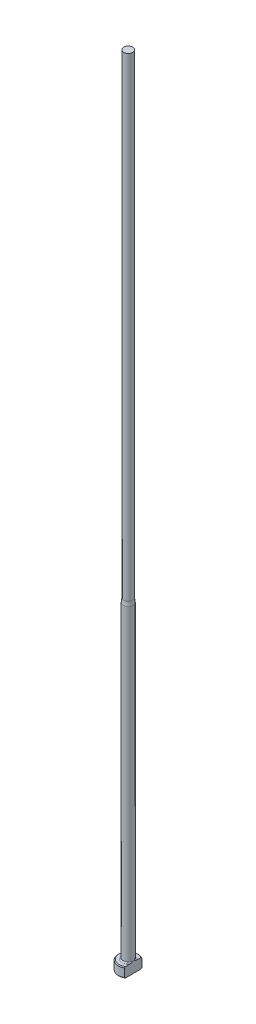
ISO-10303-21;
HEADER;
FILE_DESCRIPTION(('STEP AP214'),'2;1');
FILE_NAME('part.step','',(''),(''),'','','');
FILE_SCHEMA(('AUTOMOTIVE_DESIGN { 1 0 10303 214 1 1 1 1 }'));
ENDSEC;
DATA;
#1=APPLICATION_CONTEXT('core data for automotive mechanical design processes');
#2=APPLICATION_PROTOCOL_DEFINITION('international standard','automotive_design',2000,#1);
#3=PRODUCT_CONTEXT('',#1,'mechanical');
#4=PRODUCT('Part','Part','',(#3));
#5=PRODUCT_RELATED_PRODUCT_CATEGORY('part','',(#4));
#6=PRODUCT_DEFINITION_FORMATION('','',#4);
#7=PRODUCT_DEFINITION_CONTEXT('part definition',#1,'design');
#8=PRODUCT_DEFINITION('design','',#6,#7);
#9=PRODUCT_DEFINITION_SHAPE('','',#8);
#10=(LENGTH_UNIT() NAMED_UNIT(*) SI_UNIT(.MILLI.,.METRE.));
#11=(NAMED_UNIT(*) PLANE_ANGLE_UNIT() SI_UNIT($,.RADIAN.));
#12=(NAMED_UNIT(*) SI_UNIT($,.STERADIAN.) SOLID_ANGLE_UNIT());
#13=UNCERTAINTY_MEASURE_WITH_UNIT(LENGTH_MEASURE(1.E-05),#10,'distance_accuracy_value','');
#14=(GEOMETRIC_REPRESENTATION_CONTEXT(3) GLOBAL_UNCERTAINTY_ASSIGNED_CONTEXT((#13)) GLOBAL_UNIT_ASSIGNED_CONTEXT((#10,
#11,#12)) REPRESENTATION_CONTEXT('',''));
#15=CARTESIAN_POINT('',(0.,0.,0.));
#16=DIRECTION('',(0.,0.,1.));
#17=DIRECTION('',(1.,0.,0.));
#18=AXIS2_PLACEMENT_3D('',#15,#16,#17);
#19=CARTESIAN_POINT('',(-3.17499999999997,3.175,0.));
#20=DIRECTION('',(0.,1.,0.));
#21=DIRECTION('',(0.,0.,1.));
#22=AXIS2_PLACEMENT_3D('',#19,#20,#21);
#23=PLANE('',#22);
#24=CARTESIAN_POINT('',(0.,3.175,0.));
#25=DIRECTION('',(0.,1.,0.));
#26=DIRECTION('',(0.,0.,1.));
#27=AXIS2_PLACEMENT_3D('',#24,#25,#26);
#28=CIRCLE('',#27,2.92099999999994);
#29=CARTESIAN_POINT('',(1.58749999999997,3.175,-2.45195529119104));
#30=VERTEX_POINT('',#29);
#31=CARTESIAN_POINT('',(1.58749999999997,3.175,2.45195529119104));
#32=VERTEX_POINT('',#31);
#33=EDGE_CURVE('E105',#30,#32,#28,.T.);
#34=ORIENTED_EDGE('',*,*,#33,.T.);
#35=DIRECTION('',(0.,0.,1.));
#36=VECTOR('',#35,1.);
#37=CARTESIAN_POINT('',(1.58749999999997,3.17499999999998,2.74963065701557));
#38=LINE('',#37,#36);
#39=CARTESIAN_POINT('',(1.58749999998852,3.175,1.16397422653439));
#40=VERTEX_POINT('',#39);
#41=EDGE_CURVE('E126',#40,#32,#38,.T.);
#42=ORIENTED_EDGE('',*,*,#41,.F.);
#43=CARTESIAN_POINT('',(0.,3.175,0.));
#44=DIRECTION('',(0.,1.,0.));
#45=DIRECTION('',(0.,0.,1.));
#46=AXIS2_PLACEMENT_3D('',#43,#44,#45);
#47=CIRCLE('',#46,1.96849999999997);
#48=CARTESIAN_POINT('',(1.58749999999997,3.175,-1.16397422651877));
#49=VERTEX_POINT('',#48);
#50=EDGE_CURVE('E11',#40,#49,#47,.F.);
#51=ORIENTED_EDGE('',*,*,#50,.T.);
#52=EDGE_CURVE('E52',#30,#49,#38,.T.);
#53=ORIENTED_EDGE('',*,*,#52,.F.);
#54=EDGE_LOOP('',(#34,#42,#51,#53));
#55=FACE_BOUND('',#54,.T.);
#56=ADVANCED_FACE('F32',(#55),#23,.T.);
#57=CARTESIAN_POINT('',(0.,259.958771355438,0.));
#58=DIRECTION('',(0.,1.,0.));
#59=DIRECTION('',(0.,0.,1.));
#60=AXIS2_PLACEMENT_3D('',#57,#58,#59);
#61=CYLINDRICAL_SURFACE('',#60,3.17499999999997);
#62=CARTESIAN_POINT('',(0.,2.92100000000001,0.));
#63=DIRECTION('',(0.,1.,0.));
#64=DIRECTION('',(0.,0.,1.));
#65=AXIS2_PLACEMENT_3D('',#62,#63,#64);
#66=CIRCLE('',#65,3.17499999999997);
#67=CARTESIAN_POINT('',(1.58749999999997,2.92100000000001,2.74963065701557));
#68=VERTEX_POINT('',#67);
#69=CARTESIAN_POINT('',(1.58749999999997,2.92100000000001,-2.74963065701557));
#70=VERTEX_POINT('',#69);
#71=EDGE_CURVE('E98',#68,#70,#66,.F.);
#72=ORIENTED_EDGE('',*,*,#71,.T.);
#73=DIRECTION('',(0.,-1.,0.));
#74=VECTOR('',#73,1.);
#75=CARTESIAN_POINT('',(1.58749999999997,254.001,-2.74963065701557));
#76=LINE('',#75,#74);
#77=CARTESIAN_POINT('',(1.58749999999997,0.253999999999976,-2.74963065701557));
#78=VERTEX_POINT('',#77);
#79=EDGE_CURVE('E141',#70,#78,#76,.T.);
#80=ORIENTED_EDGE('',*,*,#79,.T.);
#81=CARTESIAN_POINT('',(0.,0.253999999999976,0.));
#82=DIRECTION('',(0.,-1.,0.));
#83=DIRECTION('',(0.,0.,-1.));
#84=AXIS2_PLACEMENT_3D('',#81,#82,#83);
#85=CIRCLE('',#84,3.17499999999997);
#86=CARTESIAN_POINT('',(1.58749999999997,0.253999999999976,2.74963065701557));
#87=VERTEX_POINT('',#86);
#88=EDGE_CURVE('E95',#78,#87,#85,.F.);
#89=ORIENTED_EDGE('',*,*,#88,.T.);
#90=DIRECTION('',(0.,-1.,0.));
#91=VECTOR('',#90,1.);
#92=CARTESIAN_POINT('',(1.58749999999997,254.001,2.74963065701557));
#93=LINE('',#92,#91);
#94=EDGE_CURVE('E88',#68,#87,#93,.T.);
#95=ORIENTED_EDGE('',*,*,#94,.F.);
#96=EDGE_LOOP('',(#72,#80,#89,#95));
#97=FACE_BOUND('',#96,.T.);
#98=ADVANCED_FACE('F191',(#97),#61,.T.);
#99=CARTESIAN_POINT('',(0.,0.,0.));
#100=DIRECTION('',(0.,-1.,0.));
#101=DIRECTION('',(0.,0.,-1.));
#102=AXIS2_PLACEMENT_3D('',#99,#100,#101);
#103=PLANE('',#102);
#104=CARTESIAN_POINT('',(0.,0.,0.));
#105=DIRECTION('',(0.,-1.,0.));
#106=DIRECTION('',(0.,0.,-1.));
#107=AXIS2_PLACEMENT_3D('',#104,#105,#106);
#108=CIRCLE('',#107,2.92100000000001);
#109=CARTESIAN_POINT('',(1.58749999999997,0.,2.45195529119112));
#110=VERTEX_POINT('',#109);
#111=CARTESIAN_POINT('',(1.58749999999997,0.,-2.45195529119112));
#112=VERTEX_POINT('',#111);
#113=EDGE_CURVE('E93',#110,#112,#108,.T.);
#114=ORIENTED_EDGE('',*,*,#113,.T.);
#115=DIRECTION('',(0.,0.,1.));
#116=VECTOR('',#115,1.);
#117=CARTESIAN_POINT('',(1.58749999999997,0.,2.74963065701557));
#118=LINE('',#117,#116);
#119=EDGE_CURVE('E78',#112,#110,#118,.T.);
#120=ORIENTED_EDGE('',*,*,#119,.T.);
#121=EDGE_LOOP('',(#114,#120));
#122=FACE_BOUND('',#121,.T.);
#123=ADVANCED_FACE('F97',(#122),#103,.T.);
#124=CARTESIAN_POINT('',(0.,3.17499999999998,0.));
#125=DIRECTION('',(0.,-1.,0.));
#126=DIRECTION('',(0.,0.,-1.));
#127=AXIS2_PLACEMENT_3D('',#124,#125,#126);
#128=CONICAL_SURFACE('',#127,2.92099999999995,0.785398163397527);
#129=ORIENTED_EDGE('',*,*,#71,.F.);
#130=CARTESIAN_POINT('',(1.58749999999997,-0.16162066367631,-6.0529050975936));
#131=CARTESIAN_POINT('',(1.58749999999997,-0.0288893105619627,-5.91567682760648));
#132=CARTESIAN_POINT('',(1.58749999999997,0.103699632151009,-5.7783103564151));
#133=CARTESIAN_POINT('',(1.58749999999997,0.368508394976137,-5.50321874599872));
#134=CARTESIAN_POINT('',(1.58749999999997,0.500728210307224,-5.36549360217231));
#135=CARTESIAN_POINT('',(1.58749999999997,0.764778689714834,-5.08953516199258));
#136=CARTESIAN_POINT('',(1.58749999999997,0.896609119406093,-4.9513016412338));
#137=CARTESIAN_POINT('',(1.58749999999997,1.15968706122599,-4.67428233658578));
#138=CARTESIAN_POINT('',(1.58749999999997,1.29093457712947,-4.53549655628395));
#139=CARTESIAN_POINT('',(1.58749999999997,1.55007705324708,-4.25997724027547));
#140=CARTESIAN_POINT('',(1.58749999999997,1.67798684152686,-4.12325766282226));
#141=CARTESIAN_POINT('',(1.58749999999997,1.9328486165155,-3.84892898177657));
#142=CARTESIAN_POINT('',(1.58749999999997,2.05980060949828,-3.71131988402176));
#143=CARTESIAN_POINT('',(1.58749999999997,2.31237508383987,-3.43493978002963));
#144=CARTESIAN_POINT('',(1.58749999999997,2.43799784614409,-3.29616903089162));
#145=CARTESIAN_POINT('',(1.58749999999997,2.68741369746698,-3.01699558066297));
#146=CARTESIAN_POINT('',(1.58749999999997,2.81120686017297,-2.8765929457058));
#147=CARTESIAN_POINT('',(1.58749999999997,3.00875865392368,-2.64816703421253));
#148=CARTESIAN_POINT('',(1.58749999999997,3.08336151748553,-2.56087478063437));
#149=CARTESIAN_POINT('',(1.58749999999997,3.2312387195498,-2.38515423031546));
#150=CARTESIAN_POINT('',(1.58749999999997,3.30451292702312,-2.29672582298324));
#151=CARTESIAN_POINT('',(1.58749999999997,3.45004422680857,-2.1174740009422));
#152=CARTESIAN_POINT('',(1.58749999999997,3.5222823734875,-2.02663514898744));
#153=CARTESIAN_POINT('',(1.58749999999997,3.66423097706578,-1.8430252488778));
#154=CARTESIAN_POINT('',(1.58749999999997,3.73394203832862,-1.75025467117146));
#155=CARTESIAN_POINT('',(1.58749999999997,3.87080633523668,-1.5606747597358));
#156=CARTESIAN_POINT('',(1.58749999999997,3.93790459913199,-1.46382547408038));
#157=CARTESIAN_POINT('',(1.58749999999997,4.06669147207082,-1.26632594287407));
#158=CARTESIAN_POINT('',(1.58749999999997,4.1283726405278,-1.16567073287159));
#159=CARTESIAN_POINT('',(1.58749999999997,4.21402252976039,-1.01165766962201));
#160=CARTESIAN_POINT('',(1.58749999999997,4.24127929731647,-0.960142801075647));
#161=CARTESIAN_POINT('',(1.58749999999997,4.2930979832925,-0.855780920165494));
#162=CARTESIAN_POINT('',(1.58749999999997,4.31765941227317,-0.802933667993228));
#163=CARTESIAN_POINT('',(1.58749999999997,4.38614656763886,-0.642461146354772));
#164=CARTESIAN_POINT('',(1.58749999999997,4.42510149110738,-0.532518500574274));
#165=CARTESIAN_POINT('',(1.58749999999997,4.46726244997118,-0.367680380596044));
#166=CARTESIAN_POINT('',(1.58749999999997,4.47844427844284,-0.314802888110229));
#167=CARTESIAN_POINT('',(1.58749999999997,4.49576654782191,-0.208209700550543));
#168=CARTESIAN_POINT('',(1.58749999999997,4.50190743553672,-0.154494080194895));
#169=CARTESIAN_POINT('',(1.58749999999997,4.50871296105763,-0.0468792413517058));
#170=CARTESIAN_POINT('',(1.58749999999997,4.5093945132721,0.00701889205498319));
#171=CARTESIAN_POINT('',(1.58749999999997,4.50527679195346,0.114606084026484));
#172=CARTESIAN_POINT('',(1.58749999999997,4.50047706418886,0.168295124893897));
#173=CARTESIAN_POINT('',(1.58749999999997,4.48579689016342,0.27448544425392));
#174=CARTESIAN_POINT('',(1.58749999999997,4.47596081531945,0.32699298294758));
#175=CARTESIAN_POINT('',(1.58749999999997,4.45181809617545,0.430974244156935));
#176=CARTESIAN_POINT('',(1.58749999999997,4.4375096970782,0.482447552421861));
#177=CARTESIAN_POINT('',(1.58749999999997,4.40502489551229,0.584460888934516));
#178=CARTESIAN_POINT('',(1.58749999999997,4.386827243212,0.634994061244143));
#179=CARTESIAN_POINT('',(1.58749999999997,4.34729308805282,0.734789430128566));
#180=CARTESIAN_POINT('',(1.58749999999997,4.3259572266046,0.784051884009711));
#181=CARTESIAN_POINT('',(1.58749999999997,4.25791922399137,0.930549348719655));
#182=CARTESIAN_POINT('',(1.58749999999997,4.20736047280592,1.0259880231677));
#183=CARTESIAN_POINT('',(1.58749999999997,4.0995545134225,1.21304313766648));
#184=CARTESIAN_POINT('',(1.58749999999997,4.04229912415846,1.30465471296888));
#185=CARTESIAN_POINT('',(1.58749999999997,3.92308746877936,1.48526211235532));
#186=CARTESIAN_POINT('',(1.58749999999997,3.86111349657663,1.57424615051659));
#187=CARTESIAN_POINT('',(1.58749999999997,3.73408621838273,1.74990003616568));
#188=CARTESIAN_POINT('',(1.58749999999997,3.66903444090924,1.83657099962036));
#189=CARTESIAN_POINT('',(1.58749999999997,3.53583371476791,2.00931764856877));
#190=CARTESIAN_POINT('',(1.58749999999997,3.46765527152,2.09537048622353));
#191=CARTESIAN_POINT('',(1.58749999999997,3.32960643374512,2.26611736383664));
#192=CARTESIAN_POINT('',(1.58749999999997,3.25973586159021,2.35081125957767));
#193=CARTESIAN_POINT('',(1.58749999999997,3.04858139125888,2.60290121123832));
#194=CARTESIAN_POINT('',(1.58749999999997,2.90542388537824,2.76872537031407));
#195=CARTESIAN_POINT('',(1.58749999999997,2.64069522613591,3.06970913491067));
#196=CARTESIAN_POINT('',(1.58749999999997,2.51959458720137,3.20528660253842));
#197=CARTESIAN_POINT('',(1.58749999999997,2.27590400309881,3.47510321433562));
#198=CARTESIAN_POINT('',(1.58749999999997,2.15331401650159,3.60934232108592));
#199=CARTESIAN_POINT('',(1.58749999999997,1.90694239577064,3.87695374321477));
#200=CARTESIAN_POINT('',(1.58749999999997,1.78315974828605,4.0103251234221));
#201=CARTESIAN_POINT('',(1.58749999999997,1.53478104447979,4.27630880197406));
#202=CARTESIAN_POINT('',(1.58749999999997,1.41018498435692,4.40892109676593));
#203=CARTESIAN_POINT('',(1.58749999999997,1.0457468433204,4.79499418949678));
#204=CARTESIAN_POINT('',(1.58749999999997,0.80507680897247,5.04767313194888));
#205=CARTESIAN_POINT('',(1.58749999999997,0.443121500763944,5.42550911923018));
#206=CARTESIAN_POINT('',(1.58749999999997,0.322378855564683,5.55118772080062));
#207=CARTESIAN_POINT('',(1.58749999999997,0.0805914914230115,5.80225207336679));
#208=CARTESIAN_POINT('',(1.58749999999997,-0.040453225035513,5.92763782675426));
#209=CARTESIAN_POINT('',(1.58749999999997,-0.161620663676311,6.0529050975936));
#210=B_SPLINE_CURVE_WITH_KNOTS('',3,(#130,#131,#132,#133,#134,#135,#136,#137,#138,#139,#140,
#141,#142,#143,#144,#145,#146,#147,#148,#149,#150,#151,#152,#153,#154,#155,#156,#157,#158,#159,
#160,#161,#162,#163,#164,#165,#166,#167,#168,#169,#170,#171,#172,#173,#174,#175,#176,#177,#178,
#179,#180,#181,#182,#183,#184,#185,#186,#187,#188,#189,#190,#191,#192,#193,#194,#195,#196,#197,
#198,#199,#200,#201,#202,#203,#204,#205,#206,#207,#208,#209),.UNSPECIFIED.,.F.,.F.,(4,2,2,2,2,2,
2,2,2,2,2,2,2,2,2,2,2,2,2,2,2,2,2,2,2,2,2,2,2,2,2,2,2,2,2,2,2,2,2,4),(0.,0.572750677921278,
1.14550874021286,1.71856057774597,2.29160869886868,2.85328006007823,3.4149477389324,
3.97649423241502,4.53801804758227,4.88249307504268,5.22700189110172,5.5751532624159,
5.92322081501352,6.27657800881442,6.63041319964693,6.80518126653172,6.9799810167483,
7.3282426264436,7.49018491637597,7.65211285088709,7.81353889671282,7.97497832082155,
8.13501929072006,8.29512313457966,8.45612518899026,8.61709438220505,8.94062993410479,
9.2645649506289,9.58978187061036,9.91483894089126,10.2441741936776,10.5735441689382,
11.2306812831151,11.7760337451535,12.3214014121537,12.8672825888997,13.4131663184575,
14.4600164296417,14.9828595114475,15.5056983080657),.UNSPECIFIED.);
#211=EDGE_CURVE('E118',#32,#68,#210,.T.);
#212=ORIENTED_EDGE('',*,*,#211,.F.);
#213=ORIENTED_EDGE('',*,*,#33,.F.);
#214=EDGE_CURVE('E117',#70,#30,#210,.T.);
#215=ORIENTED_EDGE('',*,*,#214,.F.);
#216=EDGE_LOOP('',(#129,#212,#213,#215));
#217=FACE_BOUND('',#216,.T.);
#218=ADVANCED_FACE('F162',(#217),#128,.T.);
#219=CARTESIAN_POINT('',(0.,0.253999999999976,0.));
#220=DIRECTION('',(0.,1.,0.));
#221=DIRECTION('',(0.,0.,1.));
#222=AXIS2_PLACEMENT_3D('',#219,#220,#221);
#223=CONICAL_SURFACE('',#222,3.17499999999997,0.785398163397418);
#224=ORIENTED_EDGE('',*,*,#88,.F.);
#225=CARTESIAN_POINT('',(1.58749999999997,3.33662066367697,6.0529050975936));
#226=CARTESIAN_POINT('',(1.58749999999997,3.20388931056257,5.91567682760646));
#227=CARTESIAN_POINT('',(1.58749999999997,3.07130036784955,5.77831035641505));
#228=CARTESIAN_POINT('',(1.58749999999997,2.80649160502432,5.50321874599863));
#229=CARTESIAN_POINT('',(1.58749999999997,2.67427178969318,5.3654936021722));
#230=CARTESIAN_POINT('',(1.58749999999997,2.41022131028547,5.08953516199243));
#231=CARTESIAN_POINT('',(1.58749999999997,2.27839088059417,4.95130164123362));
#232=CARTESIAN_POINT('',(1.58749999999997,2.01531293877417,4.67428233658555));
#233=CARTESIAN_POINT('',(1.58749999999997,1.88406542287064,4.5354965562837));
#234=CARTESIAN_POINT('',(1.58749999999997,1.62492294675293,4.25997724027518));
#235=CARTESIAN_POINT('',(1.58749999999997,1.49701315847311,4.12325766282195));
#236=CARTESIAN_POINT('',(1.58749999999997,1.24215138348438,3.84892898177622));
#237=CARTESIAN_POINT('',(1.58749999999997,1.11519939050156,3.71131988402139));
#238=CARTESIAN_POINT('',(1.58749999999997,0.862624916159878,3.43493978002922));
#239=CARTESIAN_POINT('',(1.58749999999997,0.737002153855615,3.29616903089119));
#240=CARTESIAN_POINT('',(1.58749999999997,0.487586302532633,3.01699558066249));
#241=CARTESIAN_POINT('',(1.58749999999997,0.363793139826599,2.8765929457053));
#242=CARTESIAN_POINT('',(1.58749999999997,0.166241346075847,2.64816703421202));
#243=CARTESIAN_POINT('',(1.58749999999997,0.0916384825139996,2.56087478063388));
#244=CARTESIAN_POINT('',(1.58749999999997,-0.0562387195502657,2.385154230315));
#245=CARTESIAN_POINT('',(1.58749999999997,-0.129512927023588,2.29672582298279));
#246=CARTESIAN_POINT('',(1.58749999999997,-0.27504422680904,2.11747400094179));
#247=CARTESIAN_POINT('',(1.58749999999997,-0.347282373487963,2.02663514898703));
#248=CARTESIAN_POINT('',(1.58749999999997,-0.489230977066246,1.84302524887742));
#249=CARTESIAN_POINT('',(1.58749999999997,-0.558942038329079,1.7502546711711));
#250=CARTESIAN_POINT('',(1.58749999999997,-0.695806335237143,1.56067475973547));
#251=CARTESIAN_POINT('',(1.58749999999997,-0.762904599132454,1.46382547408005));
#252=CARTESIAN_POINT('',(1.58749999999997,-0.891691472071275,1.26632594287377));
#253=CARTESIAN_POINT('',(1.58749999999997,-0.953372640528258,1.16567073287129));
#254=CARTESIAN_POINT('',(1.58749999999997,-1.03902252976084,1.01165766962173));
#255=CARTESIAN_POINT('',(1.58749999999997,-1.06627929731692,0.960142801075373));
#256=CARTESIAN_POINT('',(1.58749999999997,-1.11809798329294,0.85578092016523));
#257=CARTESIAN_POINT('',(1.58749999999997,-1.14265941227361,0.802933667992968));
#258=CARTESIAN_POINT('',(1.58749999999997,-1.21114656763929,0.642461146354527));
#259=CARTESIAN_POINT('',(1.58749999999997,-1.2501014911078,0.532518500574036));
#260=CARTESIAN_POINT('',(1.58749999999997,-1.29226244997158,0.367680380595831));
#261=CARTESIAN_POINT('',(1.58749999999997,-1.30344427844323,0.314802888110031));
#262=CARTESIAN_POINT('',(1.58749999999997,-1.32076654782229,0.208209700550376));
#263=CARTESIAN_POINT('',(1.58749999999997,-1.3269074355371,0.154494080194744));
#264=CARTESIAN_POINT('',(1.58749999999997,-1.333712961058,0.0468792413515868));
#265=CARTESIAN_POINT('',(1.58749999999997,-1.33439451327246,-0.00701889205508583));
#266=CARTESIAN_POINT('',(1.58749999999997,-1.33027679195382,-0.114606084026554));
#267=CARTESIAN_POINT('',(1.58749999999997,-1.32547706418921,-0.168295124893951));
#268=CARTESIAN_POINT('',(1.58749999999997,-1.31079689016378,-0.274485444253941));
#269=CARTESIAN_POINT('',(1.58749999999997,-1.3009608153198,-0.326992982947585));
#270=CARTESIAN_POINT('',(1.58749999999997,-1.27681809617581,-0.430974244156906));
#271=CARTESIAN_POINT('',(1.58749999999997,-1.26250969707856,-0.482447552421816));
#272=CARTESIAN_POINT('',(1.58749999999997,-1.23002489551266,-0.584460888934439));
#273=CARTESIAN_POINT('',(1.58749999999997,-1.21182724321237,-0.634994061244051));
#274=CARTESIAN_POINT('',(1.58749999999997,-1.1722930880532,-0.734789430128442));
#275=CARTESIAN_POINT('',(1.58749999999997,-1.15095722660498,-0.784051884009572));
#276=CARTESIAN_POINT('',(1.58749999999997,-1.08291922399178,-0.93054934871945));
#277=CARTESIAN_POINT('',(1.58749999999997,-1.03236047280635,-1.02598802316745));
#278=CARTESIAN_POINT('',(1.58749999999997,-0.924554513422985,-1.21304313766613));
#279=CARTESIAN_POINT('',(1.58749999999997,-0.86729912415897,-1.30465471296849));
#280=CARTESIAN_POINT('',(1.58749999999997,-0.748087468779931,-1.48526211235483));
#281=CARTESIAN_POINT('',(1.58749999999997,-0.686113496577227,-1.57424615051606));
#282=CARTESIAN_POINT('',(1.58749999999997,-0.55908621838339,-1.74990003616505));
#283=CARTESIAN_POINT('',(1.58749999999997,-0.494034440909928,-1.83657099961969));
#284=CARTESIAN_POINT('',(1.58749999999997,-0.360833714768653,-2.00931764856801));
#285=CARTESIAN_POINT('',(1.58749999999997,-0.292655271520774,-2.09537048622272));
#286=CARTESIAN_POINT('',(1.58749999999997,-0.154606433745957,-2.26611736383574));
#287=CARTESIAN_POINT('',(1.58749999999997,-0.0847358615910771,-2.35081125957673));
#288=CARTESIAN_POINT('',(1.58749999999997,0.126418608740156,-2.60290121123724));
#289=CARTESIAN_POINT('',(1.58749999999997,0.269576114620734,-2.76872537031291));
#290=CARTESIAN_POINT('',(1.58749999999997,0.534304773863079,-3.06970913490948));
#291=CARTESIAN_POINT('',(1.58749999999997,0.655405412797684,-3.20528660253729));
#292=CARTESIAN_POINT('',(1.58749999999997,0.899095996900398,-3.47510321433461));
#293=CARTESIAN_POINT('',(1.58749999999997,1.02168598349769,-3.60934232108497));
#294=CARTESIAN_POINT('',(1.58749999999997,1.26805760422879,-3.87695374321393));
#295=CARTESIAN_POINT('',(1.58749999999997,1.39184025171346,-4.01032512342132));
#296=CARTESIAN_POINT('',(1.58749999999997,1.64021895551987,-4.2763088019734));
#297=CARTESIAN_POINT('',(1.58749999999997,1.76481501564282,-4.40892109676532));
#298=CARTESIAN_POINT('',(1.58749999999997,2.12925315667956,-4.79499418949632));
#299=CARTESIAN_POINT('',(1.58749999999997,2.36992319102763,-5.04767313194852));
#300=CARTESIAN_POINT('',(1.58749999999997,2.73187849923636,-5.42550911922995));
#301=CARTESIAN_POINT('',(1.58749999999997,2.85262114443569,-5.55118772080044));
#302=CARTESIAN_POINT('',(1.58749999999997,3.09440850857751,-5.8022520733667));
#303=CARTESIAN_POINT('',(1.58749999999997,3.2154532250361,-5.92763782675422));
#304=CARTESIAN_POINT('',(1.58749999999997,3.33662066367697,-6.0529050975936));
#305=B_SPLINE_CURVE_WITH_KNOTS('',3,(#225,#226,#227,#228,#229,#230,#231,#232,#233,#234,#235,
#236,#237,#238,#239,#240,#241,#242,#243,#244,#245,#246,#247,#248,#249,#250,#251,#252,#253,#254,
#255,#256,#257,#258,#259,#260,#261,#262,#263,#264,#265,#266,#267,#268,#269,#270,#271,#272,#273,
#274,#275,#276,#277,#278,#279,#280,#281,#282,#283,#284,#285,#286,#287,#288,#289,#290,#291,#292,
#293,#294,#295,#296,#297,#298,#299,#300,#301,#302,#303,#304),.UNSPECIFIED.,.F.,.F.,(4,2,2,2,2,2,
2,2,2,2,2,2,2,2,2,2,2,2,2,2,2,2,2,2,2,2,2,2,2,2,2,2,2,2,2,2,2,2,2,4),(0.,0.57275067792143,
1.14550874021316,1.71856057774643,2.29160869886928,2.85328006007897,3.41494773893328,
3.97649423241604,4.53801804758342,4.88249307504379,5.2270018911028,5.57515326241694,
5.92322081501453,6.27657800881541,6.63041319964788,6.80518126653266,6.97998101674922,
7.32824262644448,7.49018491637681,7.65211285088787,7.81353889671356,7.97497832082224,
8.1350192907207,8.29512313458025,8.45612518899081,8.61709438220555,8.94062993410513,
9.26456495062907,9.58978187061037,9.91483894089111,10.2441741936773,10.5735441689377,
11.2306812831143,11.776033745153,12.3214014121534,12.8672825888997,13.4131663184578,
14.4600164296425,14.9828595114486,15.505698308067),.UNSPECIFIED.);
#306=EDGE_CURVE('E81',#112,#78,#305,.T.);
#307=ORIENTED_EDGE('',*,*,#306,.F.);
#308=ORIENTED_EDGE('',*,*,#113,.F.);
#309=EDGE_CURVE('E84',#87,#110,#305,.T.);
#310=ORIENTED_EDGE('',*,*,#309,.F.);
#311=EDGE_LOOP('',(#224,#307,#308,#310));
#312=FACE_BOUND('',#311,.T.);
#313=ADVANCED_FACE('F92',(#312),#223,.T.);
#314=CARTESIAN_POINT('',(0.,3.556,0.));
#315=DIRECTION('',(0.,1.,0.));
#316=DIRECTION('',(0.,0.,1.));
#317=AXIS2_PLACEMENT_3D('',#314,#315,#316);
#318=TOROIDAL_SURFACE('',#317,1.96849999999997,0.381);
#319=CARTESIAN_POINT('',(1.58749999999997,3.556,0.));
#320=CARTESIAN_POINT('',(1.58749999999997,3.55599928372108,-9.72839998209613E-12));
#321=CARTESIAN_POINT('',(1.58749999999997,3.55599856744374,-1.16390048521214E-07));
#322=CARTESIAN_POINT('',(1.58749999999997,3.55599717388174,-5.02802253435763E-07));
#323=CARTESIAN_POINT('',(1.58749999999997,3.55599649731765,-7.75049116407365E-07));
#324=CARTESIAN_POINT('',(1.58749999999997,3.55599515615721,-1.43578185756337E-06));
#325=CARTESIAN_POINT('',(1.58749999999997,3.55599449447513,-1.83004116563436E-06));
#326=CARTESIAN_POINT('',(1.58749999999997,3.55599322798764,-2.69326525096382E-06));
#327=CARTESIAN_POINT('',(1.58749999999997,3.55599262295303,-3.16190628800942E-06));
#328=CARTESIAN_POINT('',(1.58749999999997,3.55599066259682,-4.80183833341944E-06));
#329=CARTESIAN_POINT('',(1.58749999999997,3.55598938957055,-6.07237548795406E-06));
#330=CARTESIAN_POINT('',(1.58749999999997,3.55598706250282,-8.74131694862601E-06));
#331=CARTESIAN_POINT('',(1.58749999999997,3.55598600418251,-1.01362054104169E-05));
#332=CARTESIAN_POINT('',(1.58749999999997,3.55598220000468,-1.54025644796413E-05));
#333=CARTESIAN_POINT('',(1.58749999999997,3.55597966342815,-1.94297992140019E-05));
#334=CARTESIAN_POINT('',(1.58749999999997,3.55597535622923,-2.75116574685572E-05));
#335=CARTESIAN_POINT('',(1.58749999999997,3.55597354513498,-3.15456374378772E-05));
#336=CARTESIAN_POINT('',(1.58749999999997,3.55596616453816,-4.82039076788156E-05));
#337=CARTESIAN_POINT('',(1.58749999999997,3.55596077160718,-6.08993138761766E-05));
#338=CARTESIAN_POINT('',(1.58749999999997,3.55595181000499,-8.49758225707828E-05));
#339=CARTESIAN_POINT('',(1.58749999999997,3.55594809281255,-9.6299831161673E-05));
#340=CARTESIAN_POINT('',(1.58749999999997,3.55591954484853,-0.000176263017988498));
#341=CARTESIAN_POINT('',(1.58749999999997,3.55588430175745,-0.000240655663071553));
#342=CARTESIAN_POINT('',(1.58749999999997,3.55575419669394,-0.000487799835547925));
#343=CARTESIAN_POINT('',(1.58749999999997,3.55566706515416,-0.000673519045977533));
#344=CARTESIAN_POINT('',(1.58749999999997,3.55532896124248,-0.00138308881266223));
#345=CARTESIAN_POINT('',(1.58749999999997,3.55506990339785,-0.0019038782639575));
#346=CARTESIAN_POINT('',(1.58749999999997,3.55403272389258,-0.00399959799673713));
#347=CARTESIAN_POINT('',(1.58749999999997,3.55326363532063,-0.0055779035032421));
#348=CARTESIAN_POINT('',(1.58749999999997,3.53734419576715,-0.0382341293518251));
#349=CARTESIAN_POINT('',(1.58749999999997,3.52209124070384,-0.0692744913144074));
#350=CARTESIAN_POINT('',(1.58749999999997,3.49234031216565,-0.130397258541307));
#351=CARTESIAN_POINT('',(1.58749999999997,3.4778343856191,-0.160476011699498));
#352=CARTESIAN_POINT('',(1.58749999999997,3.44756579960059,-0.22405302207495));
#353=CARTESIAN_POINT('',(1.58749999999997,3.43183768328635,-0.257567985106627));
#354=CARTESIAN_POINT('',(1.58749999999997,3.40084315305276,-0.325196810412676));
#355=CARTESIAN_POINT('',(1.58749999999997,3.38558252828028,-0.359313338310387));
#356=CARTESIAN_POINT('',(1.58749999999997,3.35947844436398,-0.419670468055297));
#357=CARTESIAN_POINT('',(1.58749999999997,3.34845502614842,-0.445832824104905));
#358=CARTESIAN_POINT('',(1.58749999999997,3.32703860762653,-0.498343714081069));
#359=CARTESIAN_POINT('',(1.58749999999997,3.31664422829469,-0.52469168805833));
#360=CARTESIAN_POINT('',(1.58749999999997,3.2869407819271,-0.603098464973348));
#361=CARTESIAN_POINT('',(1.58749999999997,3.26865317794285,-0.655557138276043));
#362=CARTESIAN_POINT('',(1.58749999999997,3.24332469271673,-0.737608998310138));
#363=CARTESIAN_POINT('',(1.58749999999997,3.23494346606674,-0.766787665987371));
#364=CARTESIAN_POINT('',(1.58749999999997,3.21949479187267,-0.825628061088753));
#365=CARTESIAN_POINT('',(1.58749999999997,3.21243348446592,-0.855291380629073));
#366=CARTESIAN_POINT('',(1.58749999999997,3.19303275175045,-0.947623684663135));
#367=CARTESIAN_POINT('',(1.58749999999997,3.18336484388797,-1.01091582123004));
#368=CARTESIAN_POINT('',(1.58749999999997,3.17464826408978,-1.12491727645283));
#369=CARTESIAN_POINT('',(1.58749999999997,3.17379742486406,-1.17548103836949));
#370=CARTESIAN_POINT('',(1.58749999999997,3.17980825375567,-1.2756075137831));
#371=CARTESIAN_POINT('',(1.58749999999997,3.18656467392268,-1.32517446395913));
#372=CARTESIAN_POINT('',(1.58749999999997,3.20510062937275,-1.40268723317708));
#373=CARTESIAN_POINT('',(1.58749999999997,3.21379930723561,-1.43136704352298));
#374=CARTESIAN_POINT('',(1.58749999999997,3.23523847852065,-1.48727388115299));
#375=CARTESIAN_POINT('',(1.58749999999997,3.24798385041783,-1.51449910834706));
#376=CARTESIAN_POINT('',(1.58749999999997,3.27479889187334,-1.56082978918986));
#377=CARTESIAN_POINT('',(1.58749999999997,3.2880084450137,-1.5804296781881));
#378=CARTESIAN_POINT('',(1.58749999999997,3.31738741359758,-1.61726850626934));
#379=CARTESIAN_POINT('',(1.58749999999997,3.33355126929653,-1.63451177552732));
#380=CARTESIAN_POINT('',(1.58749999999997,3.3650209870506,-1.66235366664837));
#381=CARTESIAN_POINT('',(1.58749999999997,3.37976591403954,-1.67358404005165));
#382=CARTESIAN_POINT('',(1.58749999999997,3.41090649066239,-1.69348690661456));
#383=CARTESIAN_POINT('',(1.58749999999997,3.42730148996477,-1.70216040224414));
#384=CARTESIAN_POINT('',(1.58749999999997,3.46152587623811,-1.71647536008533));
#385=CARTESIAN_POINT('',(1.58749999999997,3.47936500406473,-1.72209384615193));
#386=CARTESIAN_POINT('',(1.58749999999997,3.51579449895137,-1.72977101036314));
#387=CARTESIAN_POINT('',(1.58749999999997,3.53438431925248,-1.73183223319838));
#388=CARTESIAN_POINT('',(1.58749999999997,3.5693049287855,-1.73220894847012));
#389=CARTESIAN_POINT('',(1.58749999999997,3.58563247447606,-1.73095378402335));
#390=CARTESIAN_POINT('',(1.58749999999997,3.61782719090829,-1.72566824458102));
#391=CARTESIAN_POINT('',(1.58749999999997,3.6336944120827,-1.72163817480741));
#392=CARTESIAN_POINT('',(1.58749999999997,3.66430913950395,-1.71112762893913));
#393=CARTESIAN_POINT('',(1.58749999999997,3.67907021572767,-1.70468621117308));
#394=CARTESIAN_POINT('',(1.58749999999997,3.7074589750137,-1.68967506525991));
#395=CARTESIAN_POINT('',(1.58749999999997,3.72108625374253,-1.68110458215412));
#396=CARTESIAN_POINT('',(1.58749999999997,3.75190835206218,-1.6586320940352));
#397=CARTESIAN_POINT('',(1.58749999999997,3.76852524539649,-1.64393589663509));
#398=CARTESIAN_POINT('',(1.58749999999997,3.79915076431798,-1.61203006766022));
#399=CARTESIAN_POINT('',(1.58749999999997,3.81315342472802,-1.59481484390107));
#400=CARTESIAN_POINT('',(1.58749999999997,3.84335302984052,-1.55180967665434));
#401=CARTESIAN_POINT('',(1.58749999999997,3.85840997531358,-1.52522183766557));
#402=CARTESIAN_POINT('',(1.58749999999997,3.8840928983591,-1.47008223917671));
#403=CARTESIAN_POINT('',(1.58749999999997,3.89472145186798,-1.44153163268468));
#404=CARTESIAN_POINT('',(1.58749999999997,3.91656912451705,-1.36850699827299));
#405=CARTESIAN_POINT('',(1.58749999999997,3.92534811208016,-1.32330828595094));
#406=CARTESIAN_POINT('',(1.58749999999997,3.93598980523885,-1.23163561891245));
#407=CARTESIAN_POINT('',(1.58749999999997,3.93776012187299,-1.18515271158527));
#408=CARTESIAN_POINT('',(1.58749999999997,3.93485724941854,-1.056626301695));
#409=CARTESIAN_POINT('',(1.58749999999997,3.9241811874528,-0.974728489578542));
#410=CARTESIAN_POINT('',(1.58749999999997,3.899893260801,-0.855941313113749));
#411=CARTESIAN_POINT('',(1.58749999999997,3.89075037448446,-0.817952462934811));
#412=CARTESIAN_POINT('',(1.58749999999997,3.87034922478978,-0.742758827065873));
#413=CARTESIAN_POINT('',(1.58749999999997,3.85910312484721,-0.705550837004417));
#414=CARTESIAN_POINT('',(1.58749999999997,3.83067738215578,-0.618900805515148));
#415=CARTESIAN_POINT('',(1.58749999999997,3.81279292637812,-0.56969368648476));
#416=CARTESIAN_POINT('',(1.58749999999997,3.78404415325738,-0.496059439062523));
#417=CARTESIAN_POINT('',(1.58749999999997,3.77402894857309,-0.471293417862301));
#418=CARTESIAN_POINT('',(1.58749999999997,3.75347166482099,-0.421913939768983));
#419=CARTESIAN_POINT('',(1.58749999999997,3.74292842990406,-0.39730096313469));
#420=CARTESIAN_POINT('',(1.58749999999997,3.71797467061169,-0.340371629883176));
#421=CARTESIAN_POINT('',(1.58749999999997,3.7034106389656,-0.308122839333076));
#422=CARTESIAN_POINT('',(1.58749999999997,3.67389634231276,-0.244169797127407));
#423=CARTESIAN_POINT('',(1.58749999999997,3.65895097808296,-0.212463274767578));
#424=CARTESIAN_POINT('',(1.58749999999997,3.63022587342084,-0.152300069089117));
#425=CARTESIAN_POINT('',(1.58749999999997,3.61647532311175,-0.123829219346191));
#426=CARTESIAN_POINT('',(1.58749999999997,3.58829058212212,-0.065967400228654));
#427=CARTESIAN_POINT('',(1.58749999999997,3.57384944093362,-0.036579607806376));
#428=CARTESIAN_POINT('',(1.58749999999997,3.55873641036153,-0.00557801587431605));
#429=CARTESIAN_POINT('',(1.58749999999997,3.557967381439,-0.00399981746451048));
#430=CARTESIAN_POINT('',(1.58749999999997,3.55693021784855,-0.00190412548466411));
#431=CARTESIAN_POINT('',(1.58749999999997,3.55667111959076,-0.00138325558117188));
#432=CARTESIAN_POINT('',(1.58749999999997,3.55633296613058,-0.00067358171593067));
#433=CARTESIAN_POINT('',(1.58749999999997,3.55624582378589,-0.000487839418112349));
#434=CARTESIAN_POINT('',(1.58749999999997,3.55611570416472,-0.000240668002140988));
#435=CARTESIAN_POINT('',(1.58749999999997,3.55608045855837,-0.000176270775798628));
#436=CARTESIAN_POINT('',(1.58749999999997,3.55605190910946,-9.63021903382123E-05));
#437=CARTESIAN_POINT('',(1.58749999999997,3.55604819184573,-8.49777827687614E-05));
#438=CARTESIAN_POINT('',(1.58749999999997,3.55603922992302,-6.09004217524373E-05));
#439=CARTESIAN_POINT('',(1.58749999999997,3.55603383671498,-4.82045726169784E-05));
#440=CARTESIAN_POINT('',(1.58749999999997,3.55602645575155,-3.15458034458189E-05));
#441=CARTESIAN_POINT('',(1.58749999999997,3.55602464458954,-2.75117552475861E-05));
#442=CARTESIAN_POINT('',(1.58749999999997,3.55602033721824,-1.94297725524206E-05));
#443=CARTESIAN_POINT('',(1.58749999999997,3.55601780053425,-1.54024835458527E-05));
#444=CARTESIAN_POINT('',(1.58749999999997,3.55601399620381,-1.01360754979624E-05));
#445=CARTESIAN_POINT('',(1.58749999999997,3.55601293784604,-8.7411813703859E-06));
#446=CARTESIAN_POINT('',(1.58749999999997,3.55601061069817,-6.07223627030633E-06));
#447=CARTESIAN_POINT('',(1.58749999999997,3.55600933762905,-4.80170138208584E-06));
#448=CARTESIAN_POINT('',(1.58749999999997,3.55600737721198,-3.16178168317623E-06));
#449=CARTESIAN_POINT('',(1.58749999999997,3.55600677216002,-2.69314602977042E-06));
#450=CARTESIAN_POINT('',(1.58749999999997,3.55600550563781,-1.82993577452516E-06));
#451=CARTESIAN_POINT('',(1.58749999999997,3.55600484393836,-1.43568493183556E-06));
#452=CARTESIAN_POINT('',(1.58749999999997,3.55600350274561,-7.74972790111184E-07));
#453=CARTESIAN_POINT('',(1.58749999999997,3.55600282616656,-5.02737772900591E-07));
#454=CARTESIAN_POINT('',(1.58749999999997,3.55600143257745,-1.16354060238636E-07));
#455=CARTESIAN_POINT('',(1.58749999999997,3.55600071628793,9.72852226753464E-12));
#456=CARTESIAN_POINT('',(1.58749999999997,3.556,0.));
#457=B_SPLINE_CURVE_WITH_KNOTS('',3,(#319,#320,#321,#322,#323,#324,#325,#326,#327,#328,#329,
#330,#331,#332,#333,#334,#335,#336,#337,#338,#339,#340,#341,#342,#343,#344,#345,#346,#347,#348,
#349,#350,#351,#352,#353,#354,#355,#356,#357,#358,#359,#360,#361,#362,#363,#364,#365,#366,#367,
#368,#369,#370,#371,#372,#373,#374,#375,#376,#377,#378,#379,#380,#381,#382,#383,#384,#385,#386,
#387,#388,#389,#390,#391,#392,#393,#394,#395,#396,#397,#398,#399,#400,#401,#402,#403,#404,#405,
#406,#407,#408,#409,#410,#411,#412,#413,#414,#415,#416,#417,#418,#419,#420,#421,#422,#423,#424,
#425,#426,#427,#428,#429,#430,#431,#432,#433,#434,#435,#436,#437,#438,#439,#440,#441,#442,#443,
#444,#445,#446,#447,#448,#449,#450,#451,#452,#453,#454,#455,#456),.UNSPECIFIED.,.T.,.F.,(4,2,2,
2,2,2,2,2,2,2,2,2,2,2,2,2,2,2,2,2,2,2,2,2,2,2,2,2,2,2,2,2,2,2,2,2,2,2,2,2,2,2,2,2,2,2,2,2,2,2,2,
2,2,2,2,2,2,2,2,2,2,2,2,2,2,2,2,2,4),(0.,2.14653634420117E-06,4.3243617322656E-06,
6.62715069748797E-06,8.92017875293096E-06,1.42892293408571E-05,1.95376032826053E-05,
3.37616071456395E-05,4.70144492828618E-05,8.83789092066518E-05,0.000124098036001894,
0.000343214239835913,0.000959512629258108,0.00270343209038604,0.00797166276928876,
0.11171345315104,0.21189766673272,0.322958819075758,0.435072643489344,0.520234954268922,
0.605203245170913,0.771741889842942,0.862787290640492,0.954246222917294,1.14571222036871,
1.29701464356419,1.44624921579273,1.53592478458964,1.62570887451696,1.69637166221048,
1.76690281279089,1.82229027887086,1.87765600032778,1.93343255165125,1.98916918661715,
2.03805361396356,2.08693266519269,2.13505202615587,2.18318847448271,2.24937187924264,
2.31570450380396,2.4068617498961,2.49796589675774,2.63532677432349,2.77449244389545,
3.02069049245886,3.13789423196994,3.25444001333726,3.41142684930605,3.491566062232,
3.57188909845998,3.67803747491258,3.78319074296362,3.87804579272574,3.97626481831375,
3.98153268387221,3.98327687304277,3.98389324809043,3.98411237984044,3.98414810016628,
3.98418946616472,3.98420271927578,3.98421694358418,3.98422219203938,3.9842275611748,
3.98422985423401,3.98423215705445,3.98423433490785,3.98423648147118),.UNSPECIFIED.);
#458=CARTESIAN_POINT('',(1.58749999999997,3.556,0.));
#459=VERTEX_POINT('',#458);
#460=EDGE_CURVE('E47',#459,#49,#457,.T.);
#461=ORIENTED_EDGE('',*,*,#460,.T.);
#462=ORIENTED_EDGE('',*,*,#50,.F.);
#463=CARTESIAN_POINT('',(1.58749999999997,3.556,0.));
#464=CARTESIAN_POINT('',(1.58749999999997,3.55600071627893,9.72842792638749E-12));
#465=CARTESIAN_POINT('',(1.58749999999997,3.55600143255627,1.16390048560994E-07));
#466=CARTESIAN_POINT('',(1.58749999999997,3.55600282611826,5.02802253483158E-07));
#467=CARTESIAN_POINT('',(1.58749999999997,3.55600350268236,7.7504911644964E-07));
#468=CARTESIAN_POINT('',(1.58749999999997,3.5560048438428,1.43578185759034E-06));
#469=CARTESIAN_POINT('',(1.58749999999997,3.55600550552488,1.83004116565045E-06));
#470=CARTESIAN_POINT('',(1.58749999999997,3.55600677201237,2.69326525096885E-06));
#471=CARTESIAN_POINT('',(1.58749999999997,3.55600737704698,3.16190628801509E-06));
#472=CARTESIAN_POINT('',(1.58749999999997,3.55600933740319,4.80183833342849E-06));
#473=CARTESIAN_POINT('',(1.58749999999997,3.55601061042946,6.07237548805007E-06));
#474=CARTESIAN_POINT('',(1.58749999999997,3.55601293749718,8.74131694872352E-06));
#475=CARTESIAN_POINT('',(1.58749999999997,3.55601399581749,1.01362054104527E-05));
#476=CARTESIAN_POINT('',(1.58749999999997,3.55601779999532,1.54025644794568E-05));
#477=CARTESIAN_POINT('',(1.58749999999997,3.55602033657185,1.94297992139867E-05));
#478=CARTESIAN_POINT('',(1.58749999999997,3.55602464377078,2.75116574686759E-05));
#479=CARTESIAN_POINT('',(1.58749999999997,3.55602645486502,3.15456374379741E-05));
#480=CARTESIAN_POINT('',(1.58749999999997,3.55603383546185,4.8203907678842E-05));
#481=CARTESIAN_POINT('',(1.58749999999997,3.55603922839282,6.0899313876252E-05));
#482=CARTESIAN_POINT('',(1.58749999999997,3.55604818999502,8.49758225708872E-05));
#483=CARTESIAN_POINT('',(1.58749999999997,3.55605190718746,9.62998311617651E-05));
#484=CARTESIAN_POINT('',(1.58749999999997,3.55608045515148,0.000176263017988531));
#485=CARTESIAN_POINT('',(1.58749999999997,3.55611569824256,0.000240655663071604));
#486=CARTESIAN_POINT('',(1.58749999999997,3.55624580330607,0.000487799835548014));
#487=CARTESIAN_POINT('',(1.58749999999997,3.55633293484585,0.000673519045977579));
#488=CARTESIAN_POINT('',(1.58749999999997,3.55667103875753,0.00138308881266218));
#489=CARTESIAN_POINT('',(1.58749999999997,3.55693009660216,0.00190387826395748));
#490=CARTESIAN_POINT('',(1.58749999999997,3.55796727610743,0.00399959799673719));
#491=CARTESIAN_POINT('',(1.58749999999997,3.55873636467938,0.00557790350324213));
#492=CARTESIAN_POINT('',(1.58749999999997,3.57465580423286,0.038234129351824));
#493=CARTESIAN_POINT('',(1.58749999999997,3.58990875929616,0.0692744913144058));
#494=CARTESIAN_POINT('',(1.58749999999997,3.61965968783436,0.130397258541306));
#495=CARTESIAN_POINT('',(1.58749999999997,3.63416561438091,0.160476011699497));
#496=CARTESIAN_POINT('',(1.58749999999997,3.66443420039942,0.22405302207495));
#497=CARTESIAN_POINT('',(1.58749999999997,3.68016231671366,0.257567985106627));
#498=CARTESIAN_POINT('',(1.58749999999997,3.71115684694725,0.325196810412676));
#499=CARTESIAN_POINT('',(1.58749999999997,3.72641747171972,0.359313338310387));
#500=CARTESIAN_POINT('',(1.58749999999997,3.75252155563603,0.419670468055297));
#501=CARTESIAN_POINT('',(1.58749999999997,3.76354497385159,0.445832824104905));
#502=CARTESIAN_POINT('',(1.58749999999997,3.78496139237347,0.498343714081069));
#503=CARTESIAN_POINT('',(1.58749999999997,3.79535577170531,0.524691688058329));
#504=CARTESIAN_POINT('',(1.58749999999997,3.82505921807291,0.603098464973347));
#505=CARTESIAN_POINT('',(1.58749999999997,3.84334682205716,0.655557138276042));
#506=CARTESIAN_POINT('',(1.58749999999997,3.86867530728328,0.737608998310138));
#507=CARTESIAN_POINT('',(1.58749999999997,3.87705653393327,0.766787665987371));
#508=CARTESIAN_POINT('',(1.58749999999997,3.89250520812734,0.825628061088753));
#509=CARTESIAN_POINT('',(1.58749999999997,3.89956651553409,0.855291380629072));
#510=CARTESIAN_POINT('',(1.58749999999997,3.91896724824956,0.947623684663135));
#511=CARTESIAN_POINT('',(1.58749999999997,3.92863515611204,1.01091582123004));
#512=CARTESIAN_POINT('',(1.58749999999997,3.93735173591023,1.12491727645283));
#513=CARTESIAN_POINT('',(1.58749999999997,3.93820257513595,1.17548103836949));
#514=CARTESIAN_POINT('',(1.58749999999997,3.93219174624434,1.2756075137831));
#515=CARTESIAN_POINT('',(1.58749999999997,3.92543532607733,1.32517446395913));
#516=CARTESIAN_POINT('',(1.58749999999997,3.90689937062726,1.40268723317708));
#517=CARTESIAN_POINT('',(1.58749999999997,3.8982006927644,1.43136704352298));
#518=CARTESIAN_POINT('',(1.58749999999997,3.87676152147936,1.48727388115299));
#519=CARTESIAN_POINT('',(1.58749999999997,3.86401614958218,1.51449910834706));
#520=CARTESIAN_POINT('',(1.58749999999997,3.83720110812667,1.56082978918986));
#521=CARTESIAN_POINT('',(1.58749999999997,3.82399155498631,1.5804296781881));
#522=CARTESIAN_POINT('',(1.58749999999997,3.79461258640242,1.61726850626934));
#523=CARTESIAN_POINT('',(1.58749999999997,3.77844873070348,1.63451177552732));
#524=CARTESIAN_POINT('',(1.58749999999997,3.74697901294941,1.66235366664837));
#525=CARTESIAN_POINT('',(1.58749999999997,3.73223408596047,1.67358404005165));
#526=CARTESIAN_POINT('',(1.58749999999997,3.70109350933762,1.69348690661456));
#527=CARTESIAN_POINT('',(1.58749999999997,3.68469851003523,1.70216040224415));
#528=CARTESIAN_POINT('',(1.58749999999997,3.65047412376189,1.71647536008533));
#529=CARTESIAN_POINT('',(1.58749999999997,3.63263499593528,1.72209384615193));
#530=CARTESIAN_POINT('',(1.58749999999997,3.59620550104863,1.72977101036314));
#531=CARTESIAN_POINT('',(1.58749999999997,3.57761568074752,1.73183223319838));
#532=CARTESIAN_POINT('',(1.58749999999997,3.54269507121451,1.73220894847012));
#533=CARTESIAN_POINT('',(1.58749999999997,3.52636752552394,1.73095378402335));
#534=CARTESIAN_POINT('',(1.58749999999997,3.49417280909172,1.72566824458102));
#535=CARTESIAN_POINT('',(1.58749999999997,3.47830558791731,1.72163817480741));
#536=CARTESIAN_POINT('',(1.58749999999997,3.44769086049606,1.71112762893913));
#537=CARTESIAN_POINT('',(1.58749999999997,3.43292978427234,1.70468621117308));
#538=CARTESIAN_POINT('',(1.58749999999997,3.40454102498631,1.68967506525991));
#539=CARTESIAN_POINT('',(1.58749999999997,3.39091374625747,1.68110458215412));
#540=CARTESIAN_POINT('',(1.58749999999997,3.36009164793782,1.6586320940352));
#541=CARTESIAN_POINT('',(1.58749999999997,3.34347475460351,1.64393589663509));
#542=CARTESIAN_POINT('',(1.58749999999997,3.31284923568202,1.61203006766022));
#543=CARTESIAN_POINT('',(1.58749999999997,3.29884657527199,1.59481484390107));
#544=CARTESIAN_POINT('',(1.58749999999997,3.26864697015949,1.55180967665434));
#545=CARTESIAN_POINT('',(1.58749999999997,3.25359002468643,1.52522183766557));
#546=CARTESIAN_POINT('',(1.58749999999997,3.22790710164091,1.47008223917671));
#547=CARTESIAN_POINT('',(1.58749999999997,3.21727854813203,1.44153163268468));
#548=CARTESIAN_POINT('',(1.58749999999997,3.19543087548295,1.36850699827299));
#549=CARTESIAN_POINT('',(1.58749999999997,3.18665188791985,1.32330828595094));
#550=CARTESIAN_POINT('',(1.58749999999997,3.17601019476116,1.23163561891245));
#551=CARTESIAN_POINT('',(1.58749999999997,3.17423987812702,1.18515271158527));
#552=CARTESIAN_POINT('',(1.58749999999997,3.17714275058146,1.05662630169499));
#553=CARTESIAN_POINT('',(1.58749999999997,3.18781881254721,0.974728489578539));
#554=CARTESIAN_POINT('',(1.58749999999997,3.21210673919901,0.855941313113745));
#555=CARTESIAN_POINT('',(1.58749999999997,3.22124962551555,0.817952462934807));
#556=CARTESIAN_POINT('',(1.58749999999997,3.24165077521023,0.742758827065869));
#557=CARTESIAN_POINT('',(1.58749999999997,3.25289687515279,0.705550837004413));
#558=CARTESIAN_POINT('',(1.58749999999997,3.28132261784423,0.618900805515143));
#559=CARTESIAN_POINT('',(1.58749999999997,3.29920707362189,0.569693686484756));
#560=CARTESIAN_POINT('',(1.58749999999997,3.32795584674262,0.496059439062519));
#561=CARTESIAN_POINT('',(1.58749999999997,3.33797105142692,0.471293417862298));
#562=CARTESIAN_POINT('',(1.58749999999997,3.35852833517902,0.42191393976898));
#563=CARTESIAN_POINT('',(1.58749999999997,3.36907157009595,0.397300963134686));
#564=CARTESIAN_POINT('',(1.58749999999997,3.39402532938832,0.340371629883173));
#565=CARTESIAN_POINT('',(1.58749999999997,3.40858936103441,0.308122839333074));
#566=CARTESIAN_POINT('',(1.58749999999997,3.43810365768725,0.244169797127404));
#567=CARTESIAN_POINT('',(1.58749999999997,3.45304902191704,0.212463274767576));
#568=CARTESIAN_POINT('',(1.58749999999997,3.48177412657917,0.152300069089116));
#569=CARTESIAN_POINT('',(1.58749999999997,3.49552467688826,0.123829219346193));
#570=CARTESIAN_POINT('',(1.58749999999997,3.52370941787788,0.0659674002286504));
#571=CARTESIAN_POINT('',(1.58749999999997,3.53815055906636,0.0365796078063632));
#572=CARTESIAN_POINT('',(1.58749999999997,3.55326358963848,0.00557801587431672));
#573=CARTESIAN_POINT('',(1.58749999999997,3.55403261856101,0.00399981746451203));
#574=CARTESIAN_POINT('',(1.58749999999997,3.55506978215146,0.00190412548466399));
#575=CARTESIAN_POINT('',(1.58749999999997,3.55532888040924,0.00138325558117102));
#576=CARTESIAN_POINT('',(1.58749999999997,3.55566703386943,0.00067358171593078));
#577=CARTESIAN_POINT('',(1.58749999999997,3.55575417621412,0.000487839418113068));
#578=CARTESIAN_POINT('',(1.58749999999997,3.55588429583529,0.000240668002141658));
#579=CARTESIAN_POINT('',(1.58749999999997,3.55591954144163,0.000176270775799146));
#580=CARTESIAN_POINT('',(1.58749999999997,3.55594809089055,9.63021903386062E-05));
#581=CARTESIAN_POINT('',(1.58749999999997,3.55595180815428,8.49777827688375E-05));
#582=CARTESIAN_POINT('',(1.58749999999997,3.55596077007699,6.09004217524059E-05));
#583=CARTESIAN_POINT('',(1.58749999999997,3.55596616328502,4.82045726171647E-05));
#584=CARTESIAN_POINT('',(1.58749999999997,3.55597354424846,3.15458034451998E-05));
#585=CARTESIAN_POINT('',(1.58749999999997,3.55597535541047,2.75117552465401E-05));
#586=CARTESIAN_POINT('',(1.58749999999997,3.55597966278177,1.94297725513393E-05));
#587=CARTESIAN_POINT('',(1.58749999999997,3.55598219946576,1.54024835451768E-05));
#588=CARTESIAN_POINT('',(1.58749999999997,3.5559860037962,1.01360754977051E-05));
#589=CARTESIAN_POINT('',(1.58749999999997,3.55598706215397,8.74118137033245E-06));
#590=CARTESIAN_POINT('',(1.58749999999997,3.55598938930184,6.07223627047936E-06));
#591=CARTESIAN_POINT('',(1.58749999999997,3.55599066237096,4.80170138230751E-06));
#592=CARTESIAN_POINT('',(1.58749999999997,3.55599262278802,3.16178168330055E-06));
#593=CARTESIAN_POINT('',(1.58749999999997,3.55599322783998,2.69314602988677E-06));
#594=CARTESIAN_POINT('',(1.58749999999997,3.55599449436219,1.82993577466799E-06));
#595=CARTESIAN_POINT('',(1.58749999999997,3.55599515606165,1.43568493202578E-06));
#596=CARTESIAN_POINT('',(1.58749999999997,3.5559964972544,7.749727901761E-07));
#597=CARTESIAN_POINT('',(1.58749999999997,3.55599717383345,5.02737772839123E-07));
#598=CARTESIAN_POINT('',(1.58749999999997,3.55599856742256,1.1635406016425E-07));
#599=CARTESIAN_POINT('',(1.58749999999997,3.55599928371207,-9.72855021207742E-12));
#600=CARTESIAN_POINT('',(1.58749999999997,3.556,0.));
#601=B_SPLINE_CURVE_WITH_KNOTS('',3,(#463,#464,#465,#466,#467,#468,#469,#470,#471,#472,#473,
#474,#475,#476,#477,#478,#479,#480,#481,#482,#483,#484,#485,#486,#487,#488,#489,#490,#491,#492,
#493,#494,#495,#496,#497,#498,#499,#500,#501,#502,#503,#504,#505,#506,#507,#508,#509,#510,#511,
#512,#513,#514,#515,#516,#517,#518,#519,#520,#521,#522,#523,#524,#525,#526,#527,#528,#529,#530,
#531,#532,#533,#534,#535,#536,#537,#538,#539,#540,#541,#542,#543,#544,#545,#546,#547,#548,#549,
#550,#551,#552,#553,#554,#555,#556,#557,#558,#559,#560,#561,#562,#563,#564,#565,#566,#567,#568,
#569,#570,#571,#572,#573,#574,#575,#576,#577,#578,#579,#580,#581,#582,#583,#584,#585,#586,#587,
#588,#589,#590,#591,#592,#593,#594,#595,#596,#597,#598,#599,#600),.UNSPECIFIED.,.T.,.F.,(4,2,2,
2,2,2,2,2,2,2,2,2,2,2,2,2,2,2,2,2,2,2,2,2,2,2,2,2,2,2,2,2,2,2,2,2,2,2,2,2,2,2,2,2,2,2,2,2,2,2,2,
2,2,2,2,2,2,2,2,2,2,2,2,2,2,2,2,2,4),(0.,2.14653634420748E-06,4.32436173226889E-06,
6.62715069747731E-06,8.92017875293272E-06,1.42892293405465E-05,1.95376032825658E-05,
3.37616071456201E-05,4.70144492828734E-05,8.83789092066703E-05,0.000124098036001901,
0.000343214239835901,0.000959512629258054,0.00270343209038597,0.00797166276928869,
0.111713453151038,0.21189766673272,0.322958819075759,0.435072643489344,0.520234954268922,
0.605203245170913,0.771741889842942,0.862787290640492,0.954246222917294,1.14571222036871,
1.29701464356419,1.44624921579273,1.53592478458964,1.62570887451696,1.69637166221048,
1.76690281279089,1.82229027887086,1.87765600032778,1.93343255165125,1.98916918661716,
2.03805361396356,2.08693266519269,2.13505202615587,2.18318847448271,2.24937187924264,
2.31570450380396,2.4068617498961,2.49796589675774,2.6353267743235,2.77449244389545,
3.02069049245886,3.13789423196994,3.25444001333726,3.41142684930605,3.49156606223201,
3.57188909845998,3.67803747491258,3.78319074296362,3.87804579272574,3.97626481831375,
3.98153268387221,3.98327687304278,3.98389324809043,3.98411237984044,3.98414810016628,
3.98418946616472,3.98420271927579,3.98421694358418,3.98422219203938,3.9842275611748,
3.98422985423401,3.98423215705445,3.98423433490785,3.98423648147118),.UNSPECIFIED.);
#602=EDGE_CURVE('E147',#40,#459,#601,.T.);
#603=ORIENTED_EDGE('',*,*,#602,.T.);
#604=CARTESIAN_POINT('',(0.,3.556,0.));
#605=DIRECTION('',(0.,1.,0.));
#606=DIRECTION('',(0.,0.,1.));
#607=AXIS2_PLACEMENT_3D('',#604,#605,#606);
#608=CIRCLE('',#607,1.58749999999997);
#609=EDGE_CURVE('E40',#459,#459,#608,.T.);
#610=ORIENTED_EDGE('',*,*,#609,.F.);
#611=EDGE_LOOP('',(#461,#462,#603,#610));
#612=FACE_BOUND('',#611,.T.);
#613=ADVANCED_FACE('F34',(#612),#318,.F.);
#614=CARTESIAN_POINT('',(-1.45160999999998,254.,0.));
#615=DIRECTION('',(0.,1.,0.));
#616=DIRECTION('',(0.,0.,1.));
#617=AXIS2_PLACEMENT_3D('',#614,#615,#616);
#618=PLANE('',#617);
#619=CARTESIAN_POINT('',(0.,254.,0.));
#620=DIRECTION('',(0.,1.,0.));
#621=DIRECTION('',(0.,0.,1.));
#622=AXIS2_PLACEMENT_3D('',#619,#620,#621);
#623=CIRCLE('',#622,1.45160999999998);
#624=CARTESIAN_POINT('',(0.,254.,1.45160999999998));
#625=VERTEX_POINT('',#624);
#626=EDGE_CURVE('E108',#625,#625,#623,.T.);
#627=ORIENTED_EDGE('',*,*,#626,.T.);
#628=EDGE_LOOP('',(#627));
#629=FACE_BOUND('',#628,.T.);
#630=ADVANCED_FACE('F180',(#629),#618,.T.);
#631=CARTESIAN_POINT('',(0.,259.958771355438,0.));
#632=DIRECTION('',(0.,1.,0.));
#633=DIRECTION('',(0.,0.,1.));
#634=AXIS2_PLACEMENT_3D('',#631,#632,#633);
#635=CYLINDRICAL_SURFACE('',#634,1.45160999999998);
#636=CARTESIAN_POINT('',(0.,102.906651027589,0.));
#637=DIRECTION('',(0.,1.,0.));
#638=DIRECTION('',(0.,0.,1.));
#639=AXIS2_PLACEMENT_3D('',#636,#637,#638);
#640=CIRCLE('',#639,1.45160999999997);
#641=CARTESIAN_POINT('',(0.,102.906651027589,1.45160999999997));
#642=VERTEX_POINT('',#641);
#643=EDGE_CURVE('E111',#642,#642,#640,.T.);
#644=ORIENTED_EDGE('',*,*,#643,.T.);
#645=EDGE_LOOP('',(#644));
#646=FACE_BOUND('',#645,.T.);
#647=ORIENTED_EDGE('',*,*,#626,.F.);
#648=EDGE_LOOP('',(#647));
#649=FACE_BOUND('',#648,.T.);
#650=ADVANCED_FACE('F174',(#646,#649),#635,.T.);
#651=CARTESIAN_POINT('',(0.,102.906651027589,0.));
#652=DIRECTION('',(0.,1.,0.));
#653=DIRECTION('',(0.,0.,1.));
#654=AXIS2_PLACEMENT_3D('',#651,#652,#653);
#655=TOROIDAL_SURFACE('',#654,7.80160999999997,6.35);
#656=CARTESIAN_POINT('',(0.,101.6,0.));
#657=DIRECTION('',(0.,1.,0.));
#658=DIRECTION('',(0.,0.,1.));
#659=AXIS2_PLACEMENT_3D('',#656,#657,#658);
#660=CIRCLE('',#659,1.58749999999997);
#661=CARTESIAN_POINT('',(0.,101.6,1.58749999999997));
#662=VERTEX_POINT('',#661);
#663=EDGE_CURVE('E114',#662,#662,#660,.T.);
#664=ORIENTED_EDGE('',*,*,#663,.T.);
#665=EDGE_LOOP('',(#664));
#666=FACE_BOUND('',#665,.T.);
#667=ORIENTED_EDGE('',*,*,#643,.F.);
#668=EDGE_LOOP('',(#667));
#669=FACE_BOUND('',#668,.T.);
#670=ADVANCED_FACE('F168',(#666,#669),#655,.F.);
#671=CARTESIAN_POINT('',(0.,259.958771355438,0.));
#672=DIRECTION('',(0.,1.,0.));
#673=DIRECTION('',(0.,0.,1.));
#674=AXIS2_PLACEMENT_3D('',#671,#672,#673);
#675=CYLINDRICAL_SURFACE('',#674,1.58749999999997);
#676=ORIENTED_EDGE('',*,*,#609,.T.);
#677=EDGE_LOOP('',(#676));
#678=FACE_BOUND('',#677,.T.);
#679=ORIENTED_EDGE('',*,*,#663,.F.);
#680=EDGE_LOOP('',(#679));
#681=FACE_BOUND('',#680,.T.);
#682=ADVANCED_FACE('F165',(#678,#681),#675,.T.);
#683=CARTESIAN_POINT('',(1.58749999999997,254.001,2.74963065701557));
#684=DIRECTION('',(1.,0.,0.));
#685=DIRECTION('',(0.,0.,-1.));
#686=AXIS2_PLACEMENT_3D('',#683,#684,#685);
#687=PLANE('',#686);
#688=ORIENTED_EDGE('',*,*,#309,.T.);
#689=ORIENTED_EDGE('',*,*,#119,.F.);
#690=ORIENTED_EDGE('',*,*,#306,.T.);
#691=ORIENTED_EDGE('',*,*,#79,.F.);
#692=ORIENTED_EDGE('',*,*,#214,.T.);
#693=ORIENTED_EDGE('',*,*,#52,.T.);
#694=ORIENTED_EDGE('',*,*,#460,.F.);
#695=ORIENTED_EDGE('',*,*,#602,.F.);
#696=ORIENTED_EDGE('',*,*,#41,.T.);
#697=ORIENTED_EDGE('',*,*,#211,.T.);
#698=ORIENTED_EDGE('',*,*,#94,.T.);
#699=EDGE_LOOP('',(#688,#689,#690,#691,#692,#693,#694,#695,#696,#697,#698));
#700=FACE_BOUND('',#699,.T.);
#701=ADVANCED_FACE('F80',(#700),#687,.T.);
#702=CLOSED_SHELL('',(#56,#98,#123,#218,#313,#613,#630,#650,#670,#682,#701));
#703=MANIFOLD_SOLID_BREP('B2',#702);
#704=ADVANCED_BREP_SHAPE_REPRESENTATION('',(#18,#703),#14);
#705=SHAPE_DEFINITION_REPRESENTATION(#9,#704);
ENDSEC;
END-ISO-10303-21;
